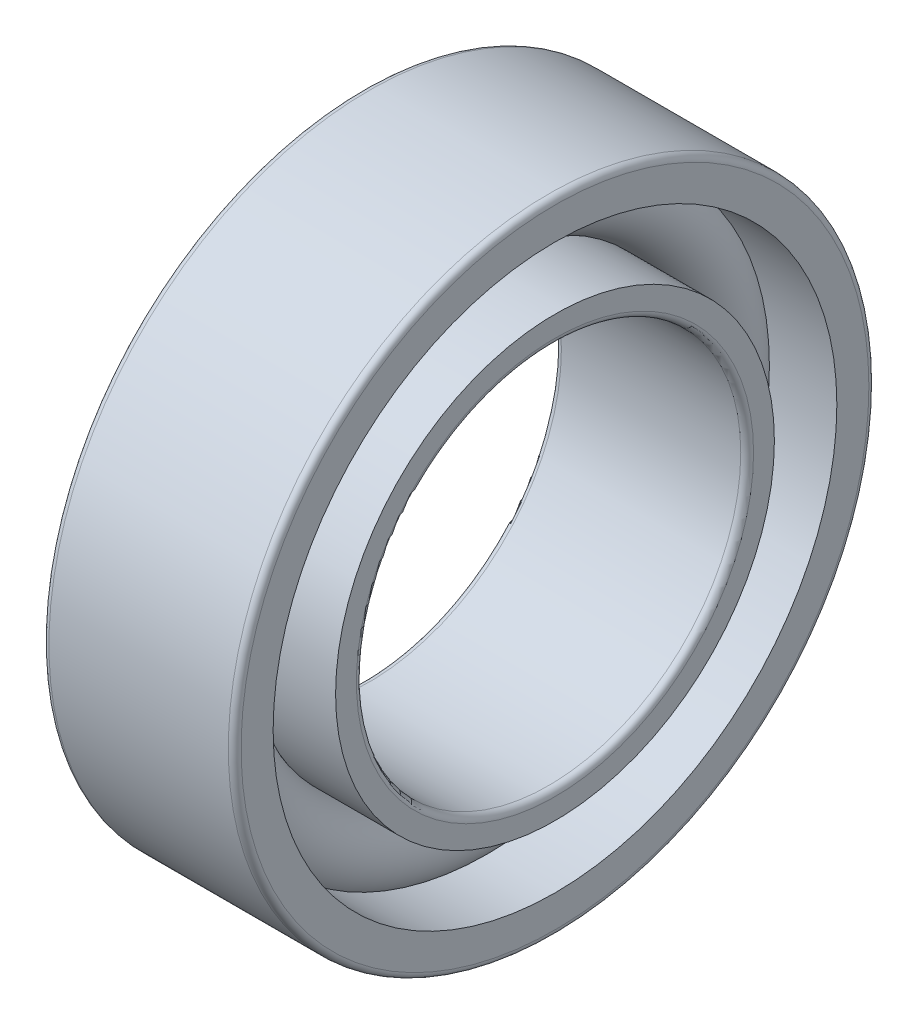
ISO-10303-21;
HEADER;
FILE_DESCRIPTION(('STEP AP214'),'2;1');
FILE_NAME('part.step','',(''),(''),'','','');
FILE_SCHEMA(('AUTOMOTIVE_DESIGN { 1 0 10303 214 1 1 1 1 }'));
ENDSEC;
DATA;
#1=APPLICATION_CONTEXT('core data for automotive mechanical design processes');
#2=APPLICATION_PROTOCOL_DEFINITION('international standard','automotive_design',2000,#1);
#3=PRODUCT_CONTEXT('',#1,'mechanical');
#4=PRODUCT('Part','Part','',(#3));
#5=PRODUCT_RELATED_PRODUCT_CATEGORY('part','',(#4));
#6=PRODUCT_DEFINITION_FORMATION('','',#4);
#7=PRODUCT_DEFINITION_CONTEXT('part definition',#1,'design');
#8=PRODUCT_DEFINITION('design','',#6,#7);
#9=PRODUCT_DEFINITION_SHAPE('','',#8);
#10=(LENGTH_UNIT() NAMED_UNIT(*) SI_UNIT(.MILLI.,.METRE.));
#11=(NAMED_UNIT(*) PLANE_ANGLE_UNIT() SI_UNIT($,.RADIAN.));
#12=(NAMED_UNIT(*) SI_UNIT($,.STERADIAN.) SOLID_ANGLE_UNIT());
#13=UNCERTAINTY_MEASURE_WITH_UNIT(LENGTH_MEASURE(1.E-05),#10,'distance_accuracy_value','');
#14=(GEOMETRIC_REPRESENTATION_CONTEXT(3) GLOBAL_UNCERTAINTY_ASSIGNED_CONTEXT((#13)) GLOBAL_UNIT_ASSIGNED_CONTEXT((#10,
#11,#12)) REPRESENTATION_CONTEXT('',''));
#15=CARTESIAN_POINT('',(0.,0.,0.));
#16=DIRECTION('',(0.,0.,1.));
#17=DIRECTION('',(1.,0.,0.));
#18=AXIS2_PLACEMENT_3D('',#15,#16,#17);
#19=CARTESIAN_POINT('',(0.,0.,0.));
#20=DIRECTION('',(-1.,0.,0.));
#21=DIRECTION('',(0.,0.,1.));
#22=AXIS2_PLACEMENT_3D('',#19,#20,#21);
#23=TOROIDAL_SURFACE('',#22,4.,0.6);
#24=CARTESIAN_POINT('',(0.447213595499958,0.,0.));
#25=DIRECTION('',(-1.,0.,0.));
#26=DIRECTION('',(0.,0.,1.));
#27=AXIS2_PLACEMENT_3D('',#24,#25,#26);
#28=CIRCLE('',#27,4.4);
#29=CARTESIAN_POINT('',(0.447213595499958,0.,4.4));
#30=VERTEX_POINT('',#29);
#31=EDGE_CURVE('E35',#30,#30,#28,.F.);
#32=ORIENTED_EDGE('',*,*,#31,.T.);
#33=EDGE_LOOP('',(#32));
#34=FACE_BOUND('',#33,.T.);
#35=CARTESIAN_POINT('',(0.171391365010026,0.,0.));
#36=DIRECTION('',(-1.,0.,0.));
#37=DIRECTION('',(0.,0.,1.));
#38=AXIS2_PLACEMENT_3D('',#35,#36,#37);
#39=CIRCLE('',#38,3.425);
#40=CARTESIAN_POINT('',(0.171391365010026,0.,3.425));
#41=VERTEX_POINT('',#40);
#42=EDGE_CURVE('E10',#41,#41,#39,.T.);
#43=ORIENTED_EDGE('',*,*,#42,.T.);
#44=EDGE_LOOP('',(#43));
#45=FACE_BOUND('',#44,.T.);
#46=ADVANCED_FACE('F31',(#34,#45),#23,.T.);
#47=CARTESIAN_POINT('',(-20.6375,0.,0.));
#48=DIRECTION('',(1.,0.,0.));
#49=DIRECTION('',(0.,0.,-1.));
#50=AXIS2_PLACEMENT_3D('',#47,#48,#49);
#51=CYLINDRICAL_SURFACE('',#50,3.425);
#52=CARTESIAN_POINT('',(1.5,0.,0.));
#53=DIRECTION('',(1.,0.,0.));
#54=DIRECTION('',(0.,0.,-1.));
#55=AXIS2_PLACEMENT_3D('',#52,#53,#54);
#56=CIRCLE('',#55,3.425);
#57=CARTESIAN_POINT('',(1.5,0.,-3.425));
#58=VERTEX_POINT('',#57);
#59=EDGE_CURVE('E44',#58,#58,#56,.T.);
#60=ORIENTED_EDGE('',*,*,#59,.F.);
#61=EDGE_LOOP('',(#60));
#62=FACE_BOUND('',#61,.T.);
#63=ORIENTED_EDGE('',*,*,#42,.F.);
#64=EDGE_LOOP('',(#63));
#65=FACE_BOUND('',#64,.T.);
#66=ADVANCED_FACE('F83',(#62,#65),#51,.T.);
#67=CARTESIAN_POINT('',(-20.6375,0.,0.));
#68=DIRECTION('',(1.,0.,0.));
#69=DIRECTION('',(0.,0.,-1.));
#70=AXIS2_PLACEMENT_3D('',#67,#68,#69);
#71=CYLINDRICAL_SURFACE('',#70,3.6);
#72=CARTESIAN_POINT('',(-1.5,0.,0.));
#73=DIRECTION('',(1.,0.,0.));
#74=DIRECTION('',(0.,0.,-1.));
#75=AXIS2_PLACEMENT_3D('',#72,#73,#74);
#76=CIRCLE('',#75,3.6);
#77=CARTESIAN_POINT('',(-1.5,0.,-3.6));
#78=VERTEX_POINT('',#77);
#79=EDGE_CURVE('E53',#78,#78,#76,.T.);
#80=ORIENTED_EDGE('',*,*,#79,.T.);
#81=EDGE_LOOP('',(#80));
#82=FACE_BOUND('',#81,.T.);
#83=CARTESIAN_POINT('',(-0.447213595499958,0.,0.));
#84=DIRECTION('',(1.,0.,0.));
#85=DIRECTION('',(0.,0.,-1.));
#86=AXIS2_PLACEMENT_3D('',#83,#84,#85);
#87=CIRCLE('',#86,3.6);
#88=CARTESIAN_POINT('',(-0.447213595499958,0.,-3.6));
#89=VERTEX_POINT('',#88);
#90=EDGE_CURVE('E39',#89,#89,#87,.T.);
#91=ORIENTED_EDGE('',*,*,#90,.F.);
#92=EDGE_LOOP('',(#91));
#93=FACE_BOUND('',#92,.T.);
#94=ADVANCED_FACE('F86',(#82,#93),#71,.T.);
#95=CARTESIAN_POINT('',(1.5,3.1,0.));
#96=DIRECTION('',(1.,0.,0.));
#97=DIRECTION('',(0.,0.,-1.));
#98=AXIS2_PLACEMENT_3D('',#95,#96,#97);
#99=PLANE('',#98);
#100=ORIENTED_EDGE('',*,*,#59,.T.);
#101=EDGE_LOOP('',(#100));
#102=FACE_BOUND('',#101,.T.);
#103=CARTESIAN_POINT('',(1.5,0.,0.));
#104=DIRECTION('',(1.,0.,0.));
#105=DIRECTION('',(0.,0.,-1.));
#106=AXIS2_PLACEMENT_3D('',#103,#104,#105);
#107=CIRCLE('',#106,3.1);
#108=CARTESIAN_POINT('',(1.5,0.,-3.1));
#109=VERTEX_POINT('',#108);
#110=EDGE_CURVE('E75',#109,#109,#107,.T.);
#111=ORIENTED_EDGE('',*,*,#110,.F.);
#112=EDGE_LOOP('',(#111));
#113=FACE_BOUND('',#112,.T.);
#114=ADVANCED_FACE('F80',(#102,#113),#99,.T.);
#115=CARTESIAN_POINT('',(1.4,0.,0.));
#116=DIRECTION('',(1.,0.,0.));
#117=DIRECTION('',(0.,0.,-1.));
#118=AXIS2_PLACEMENT_3D('',#115,#116,#117);
#119=TOROIDAL_SURFACE('',#118,3.1,0.0999999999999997);
#120=ORIENTED_EDGE('',*,*,#110,.T.);
#121=EDGE_LOOP('',(#120));
#122=FACE_BOUND('',#121,.T.);
#123=CARTESIAN_POINT('',(1.4,0.,0.));
#124=DIRECTION('',(1.,0.,0.));
#125=DIRECTION('',(0.,0.,-1.));
#126=AXIS2_PLACEMENT_3D('',#123,#124,#125);
#127=CIRCLE('',#126,3.);
#128=CARTESIAN_POINT('',(1.4,0.,-3.));
#129=VERTEX_POINT('',#128);
#130=EDGE_CURVE('E72',#129,#129,#127,.T.);
#131=ORIENTED_EDGE('',*,*,#130,.F.);
#132=EDGE_LOOP('',(#131));
#133=FACE_BOUND('',#132,.T.);
#134=ADVANCED_FACE('F97',(#122,#133),#119,.T.);
#135=CARTESIAN_POINT('',(-20.6375,0.,0.));
#136=DIRECTION('',(1.,0.,0.));
#137=DIRECTION('',(0.,0.,-1.));
#138=AXIS2_PLACEMENT_3D('',#135,#136,#137);
#139=CYLINDRICAL_SURFACE('',#138,3.);
#140=ORIENTED_EDGE('',*,*,#130,.T.);
#141=EDGE_LOOP('',(#140));
#142=FACE_BOUND('',#141,.T.);
#143=CARTESIAN_POINT('',(-1.4,0.,0.));
#144=DIRECTION('',(1.,0.,0.));
#145=DIRECTION('',(0.,0.,-1.));
#146=AXIS2_PLACEMENT_3D('',#143,#144,#145);
#147=CIRCLE('',#146,3.);
#148=CARTESIAN_POINT('',(-1.4,0.,-3.));
#149=VERTEX_POINT('',#148);
#150=EDGE_CURVE('E69',#149,#149,#147,.T.);
#151=ORIENTED_EDGE('',*,*,#150,.F.);
#152=EDGE_LOOP('',(#151));
#153=FACE_BOUND('',#152,.T.);
#154=ADVANCED_FACE('F100',(#142,#153),#139,.F.);
#155=CARTESIAN_POINT('',(-1.4,0.,0.));
#156=DIRECTION('',(1.,0.,0.));
#157=DIRECTION('',(0.,0.,-1.));
#158=AXIS2_PLACEMENT_3D('',#155,#156,#157);
#159=TOROIDAL_SURFACE('',#158,3.1,0.0999999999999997);
#160=ORIENTED_EDGE('',*,*,#150,.T.);
#161=EDGE_LOOP('',(#160));
#162=FACE_BOUND('',#161,.T.);
#163=CARTESIAN_POINT('',(-1.5,0.,0.));
#164=DIRECTION('',(1.,0.,0.));
#165=DIRECTION('',(0.,0.,-1.));
#166=AXIS2_PLACEMENT_3D('',#163,#164,#165);
#167=CIRCLE('',#166,3.1);
#168=CARTESIAN_POINT('',(-1.5,0.,-3.1));
#169=VERTEX_POINT('',#168);
#170=EDGE_CURVE('E66',#169,#169,#167,.T.);
#171=ORIENTED_EDGE('',*,*,#170,.F.);
#172=EDGE_LOOP('',(#171));
#173=FACE_BOUND('',#172,.T.);
#174=ADVANCED_FACE('F104',(#162,#173),#159,.T.);
#175=CARTESIAN_POINT('',(-1.5,3.6,0.));
#176=DIRECTION('',(-1.,0.,0.));
#177=DIRECTION('',(0.,0.,1.));
#178=AXIS2_PLACEMENT_3D('',#175,#176,#177);
#179=PLANE('',#178);
#180=ORIENTED_EDGE('',*,*,#170,.T.);
#181=EDGE_LOOP('',(#180));
#182=FACE_BOUND('',#181,.T.);
#183=ORIENTED_EDGE('',*,*,#79,.F.);
#184=EDGE_LOOP('',(#183));
#185=FACE_BOUND('',#184,.T.);
#186=ADVANCED_FACE('F108',(#182,#185),#179,.T.);
#187=CARTESIAN_POINT('',(-0.171391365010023,0.,0.));
#188=DIRECTION('',(1.,0.,0.));
#189=DIRECTION('',(0.,0.,-1.));
#190=AXIS2_PLACEMENT_3D('',#187,#188,#189);
#191=CIRCLE('',#190,4.575);
#192=CARTESIAN_POINT('',(-0.171391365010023,0.,-4.575));
#193=VERTEX_POINT('',#192);
#194=EDGE_CURVE('E47',#193,#193,#191,.F.);
#195=ORIENTED_EDGE('',*,*,#194,.T.);
#196=EDGE_LOOP('',(#195));
#197=FACE_BOUND('',#196,.T.);
#198=ORIENTED_EDGE('',*,*,#90,.T.);
#199=EDGE_LOOP('',(#198));
#200=FACE_BOUND('',#199,.T.);
#201=ADVANCED_FACE('F33',(#197,#200),#23,.T.);
#202=CARTESIAN_POINT('',(-20.6375,0.,0.));
#203=DIRECTION('',(1.,0.,0.));
#204=DIRECTION('',(0.,0.,-1.));
#205=AXIS2_PLACEMENT_3D('',#202,#203,#204);
#206=CYLINDRICAL_SURFACE('',#205,4.4);
#207=CARTESIAN_POINT('',(1.5,0.,0.));
#208=DIRECTION('',(1.,0.,0.));
#209=DIRECTION('',(0.,0.,-1.));
#210=AXIS2_PLACEMENT_3D('',#207,#208,#209);
#211=CIRCLE('',#210,4.4);
#212=CARTESIAN_POINT('',(1.5,0.,-4.4));
#213=VERTEX_POINT('',#212);
#214=EDGE_CURVE('E149',#213,#213,#211,.T.);
#215=ORIENTED_EDGE('',*,*,#214,.T.);
#216=EDGE_LOOP('',(#215));
#217=FACE_BOUND('',#216,.T.);
#218=ORIENTED_EDGE('',*,*,#31,.F.);
#219=EDGE_LOOP('',(#218));
#220=FACE_BOUND('',#219,.T.);
#221=ADVANCED_FACE('F130',(#217,#220),#206,.F.);
#222=CARTESIAN_POINT('',(-20.6375,0.,0.));
#223=DIRECTION('',(1.,0.,0.));
#224=DIRECTION('',(0.,0.,-1.));
#225=AXIS2_PLACEMENT_3D('',#222,#223,#224);
#226=CYLINDRICAL_SURFACE('',#225,4.575);
#227=CARTESIAN_POINT('',(-1.5,0.,0.));
#228=DIRECTION('',(1.,0.,0.));
#229=DIRECTION('',(0.,0.,-1.));
#230=AXIS2_PLACEMENT_3D('',#227,#228,#229);
#231=CIRCLE('',#230,4.575);
#232=CARTESIAN_POINT('',(-1.5,0.,-4.575));
#233=VERTEX_POINT('',#232);
#234=EDGE_CURVE('E144',#233,#233,#231,.T.);
#235=ORIENTED_EDGE('',*,*,#234,.F.);
#236=EDGE_LOOP('',(#235));
#237=FACE_BOUND('',#236,.T.);
#238=ORIENTED_EDGE('',*,*,#194,.F.);
#239=EDGE_LOOP('',(#238));
#240=FACE_BOUND('',#239,.T.);
#241=ADVANCED_FACE('F117',(#237,#240),#226,.F.);
#242=CARTESIAN_POINT('',(-1.4,0.,0.));
#243=DIRECTION('',(1.,0.,0.));
#244=DIRECTION('',(0.,0.,-1.));
#245=AXIS2_PLACEMENT_3D('',#242,#243,#244);
#246=TOROIDAL_SURFACE('',#245,4.9,0.0999999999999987);
#247=CARTESIAN_POINT('',(-1.5,0.,0.));
#248=DIRECTION('',(1.,0.,0.));
#249=DIRECTION('',(0.,0.,-1.));
#250=AXIS2_PLACEMENT_3D('',#247,#248,#249);
#251=CIRCLE('',#250,4.9);
#252=CARTESIAN_POINT('',(-1.5,0.,-4.9));
#253=VERTEX_POINT('',#252);
#254=EDGE_CURVE('E147',#253,#253,#251,.T.);
#255=ORIENTED_EDGE('',*,*,#254,.T.);
#256=EDGE_LOOP('',(#255));
#257=FACE_BOUND('',#256,.T.);
#258=CARTESIAN_POINT('',(-1.4,0.,0.));
#259=DIRECTION('',(1.,0.,0.));
#260=DIRECTION('',(0.,0.,-1.));
#261=AXIS2_PLACEMENT_3D('',#258,#259,#260);
#262=CIRCLE('',#261,5.);
#263=CARTESIAN_POINT('',(-1.4,0.,-5.));
#264=VERTEX_POINT('',#263);
#265=EDGE_CURVE('E49',#264,#264,#262,.T.);
#266=ORIENTED_EDGE('',*,*,#265,.F.);
#267=EDGE_LOOP('',(#266));
#268=FACE_BOUND('',#267,.T.);
#269=ADVANCED_FACE('F113',(#257,#268),#246,.T.);
#270=CARTESIAN_POINT('',(-20.6375,0.,0.));
#271=DIRECTION('',(1.,0.,0.));
#272=DIRECTION('',(0.,0.,-1.));
#273=AXIS2_PLACEMENT_3D('',#270,#271,#272);
#274=CYLINDRICAL_SURFACE('',#273,5.);
#275=ORIENTED_EDGE('',*,*,#265,.T.);
#276=EDGE_LOOP('',(#275));
#277=FACE_BOUND('',#276,.T.);
#278=CARTESIAN_POINT('',(1.4,0.,0.));
#279=DIRECTION('',(1.,0.,0.));
#280=DIRECTION('',(0.,0.,-1.));
#281=AXIS2_PLACEMENT_3D('',#278,#279,#280);
#282=CIRCLE('',#281,5.);
#283=CARTESIAN_POINT('',(1.4,0.,-5.));
#284=VERTEX_POINT('',#283);
#285=EDGE_CURVE('E55',#284,#284,#282,.T.);
#286=ORIENTED_EDGE('',*,*,#285,.F.);
#287=EDGE_LOOP('',(#286));
#288=FACE_BOUND('',#287,.T.);
#289=ADVANCED_FACE('F116',(#277,#288),#274,.T.);
#290=CARTESIAN_POINT('',(1.4,0.,0.));
#291=DIRECTION('',(1.,0.,0.));
#292=DIRECTION('',(0.,0.,-1.));
#293=AXIS2_PLACEMENT_3D('',#290,#291,#292);
#294=TOROIDAL_SURFACE('',#293,4.9,0.0999999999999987);
#295=ORIENTED_EDGE('',*,*,#285,.T.);
#296=EDGE_LOOP('',(#295));
#297=FACE_BOUND('',#296,.T.);
#298=CARTESIAN_POINT('',(1.5,0.,0.));
#299=DIRECTION('',(1.,0.,0.));
#300=DIRECTION('',(0.,0.,-1.));
#301=AXIS2_PLACEMENT_3D('',#298,#299,#300);
#302=CIRCLE('',#301,4.9);
#303=CARTESIAN_POINT('',(1.5,0.,-4.9));
#304=VERTEX_POINT('',#303);
#305=EDGE_CURVE('E60',#304,#304,#302,.T.);
#306=ORIENTED_EDGE('',*,*,#305,.F.);
#307=EDGE_LOOP('',(#306));
#308=FACE_BOUND('',#307,.T.);
#309=ADVANCED_FACE('F121',(#297,#308),#294,.T.);
#310=CARTESIAN_POINT('',(1.5,4.9,0.));
#311=DIRECTION('',(1.,0.,0.));
#312=DIRECTION('',(0.,0.,-1.));
#313=AXIS2_PLACEMENT_3D('',#310,#311,#312);
#314=PLANE('',#313);
#315=ORIENTED_EDGE('',*,*,#305,.T.);
#316=EDGE_LOOP('',(#315));
#317=FACE_BOUND('',#316,.T.);
#318=ORIENTED_EDGE('',*,*,#214,.F.);
#319=EDGE_LOOP('',(#318));
#320=FACE_BOUND('',#319,.T.);
#321=ADVANCED_FACE('F124',(#317,#320),#314,.T.);
#322=CARTESIAN_POINT('',(-1.5,4.575,0.));
#323=DIRECTION('',(-1.,0.,0.));
#324=DIRECTION('',(0.,0.,1.));
#325=AXIS2_PLACEMENT_3D('',#322,#323,#324);
#326=PLANE('',#325);
#327=ORIENTED_EDGE('',*,*,#234,.T.);
#328=EDGE_LOOP('',(#327));
#329=FACE_BOUND('',#328,.T.);
#330=ORIENTED_EDGE('',*,*,#254,.F.);
#331=EDGE_LOOP('',(#330));
#332=FACE_BOUND('',#331,.T.);
#333=ADVANCED_FACE('F128',(#329,#332),#326,.T.);
#334=CLOSED_SHELL('',(#46,#66,#94,#114,#134,#154,#174,#186,#201,#221,#241,#269,#289,#309,#321,#333));
#335=MANIFOLD_SOLID_BREP('B2',#334);
#336=ADVANCED_BREP_SHAPE_REPRESENTATION('',(#18,#335),#14);
#337=SHAPE_DEFINITION_REPRESENTATION(#9,#336);
ENDSEC;
END-ISO-10303-21;
